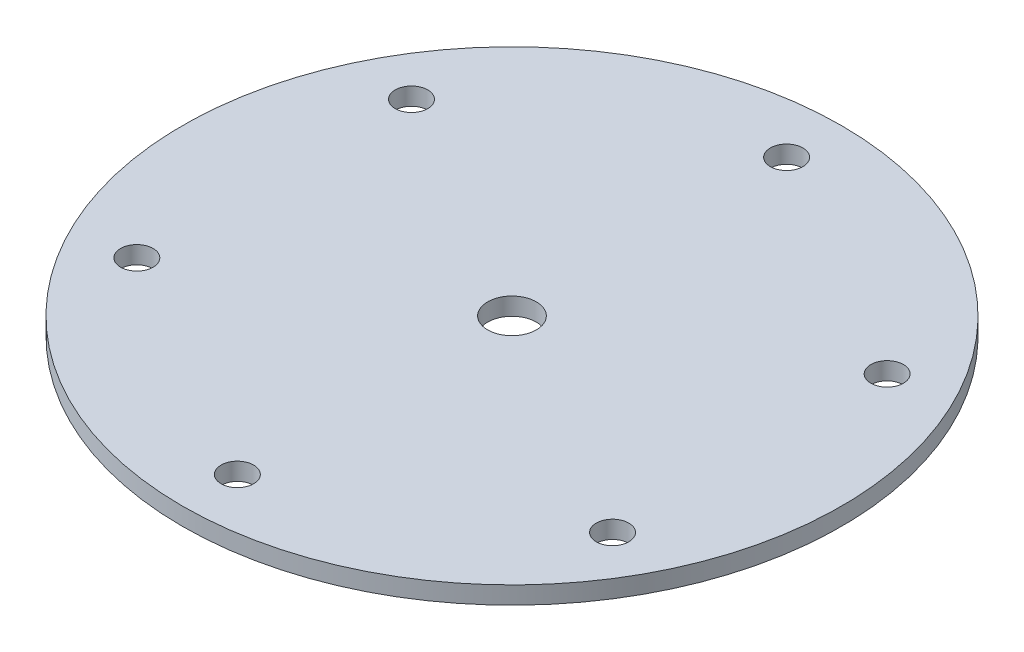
ISO-10303-21;
HEADER;
FILE_DESCRIPTION(('STEP AP214'),'2;1');
FILE_NAME('part.step','',(''),(''),'','','');
FILE_SCHEMA(('AUTOMOTIVE_DESIGN { 1 0 10303 214 1 1 1 1 }'));
ENDSEC;
DATA;
#1=APPLICATION_CONTEXT('core data for automotive mechanical design processes');
#2=APPLICATION_PROTOCOL_DEFINITION('international standard','automotive_design',2000,#1);
#3=PRODUCT_CONTEXT('',#1,'mechanical');
#4=PRODUCT('Part','Part','',(#3));
#5=PRODUCT_RELATED_PRODUCT_CATEGORY('part','',(#4));
#6=PRODUCT_DEFINITION_FORMATION('','',#4);
#7=PRODUCT_DEFINITION_CONTEXT('part definition',#1,'design');
#8=PRODUCT_DEFINITION('design','',#6,#7);
#9=PRODUCT_DEFINITION_SHAPE('','',#8);
#10=(LENGTH_UNIT() NAMED_UNIT(*) SI_UNIT(.MILLI.,.METRE.));
#11=(NAMED_UNIT(*) PLANE_ANGLE_UNIT() SI_UNIT($,.RADIAN.));
#12=(NAMED_UNIT(*) SI_UNIT($,.STERADIAN.) SOLID_ANGLE_UNIT());
#13=UNCERTAINTY_MEASURE_WITH_UNIT(LENGTH_MEASURE(1.E-05),#10,'distance_accuracy_value','');
#14=(GEOMETRIC_REPRESENTATION_CONTEXT(3) GLOBAL_UNCERTAINTY_ASSIGNED_CONTEXT((#13)) GLOBAL_UNIT_ASSIGNED_CONTEXT((#10,
#11,#12)) REPRESENTATION_CONTEXT('',''));
#15=CARTESIAN_POINT('',(0.,0.,0.));
#16=DIRECTION('',(0.,0.,1.));
#17=DIRECTION('',(1.,0.,0.));
#18=AXIS2_PLACEMENT_3D('',#15,#16,#17);
#19=CARTESIAN_POINT('',(-41.2444598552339,3.048,23.8124999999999));
#20=DIRECTION('',(0.,1.,0.));
#21=DIRECTION('',(0.,0.,1.));
#22=AXIS2_PLACEMENT_3D('',#19,#20,#21);
#23=CYLINDRICAL_SURFACE('',#22,2.8194);
#24=CARTESIAN_POINT('',(-41.2444598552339,3.048,23.8124999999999));
#25=DIRECTION('',(0.,1.,0.));
#26=DIRECTION('',(0.,0.,1.));
#27=AXIS2_PLACEMENT_3D('',#24,#25,#26);
#28=CIRCLE('',#27,2.8194);
#29=CARTESIAN_POINT('',(-41.2444598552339,3.048,26.6318999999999));
#30=VERTEX_POINT('',#29);
#31=EDGE_CURVE('E72',#30,#30,#28,.T.);
#32=ORIENTED_EDGE('',*,*,#31,.T.);
#33=EDGE_LOOP('',(#32));
#34=FACE_BOUND('',#33,.T.);
#35=CARTESIAN_POINT('',(-41.2444598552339,0.,23.8124999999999));
#36=DIRECTION('',(0.,1.,0.));
#37=DIRECTION('',(0.,0.,1.));
#38=AXIS2_PLACEMENT_3D('',#35,#36,#37);
#39=CIRCLE('',#38,2.8194);
#40=CARTESIAN_POINT('',(-41.2444598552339,0.,26.6318999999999));
#41=VERTEX_POINT('',#40);
#42=EDGE_CURVE('E52',#41,#41,#39,.T.);
#43=ORIENTED_EDGE('',*,*,#42,.F.);
#44=EDGE_LOOP('',(#43));
#45=FACE_BOUND('',#44,.T.);
#46=ADVANCED_FACE('F35',(#34,#45),#23,.F.);
#47=CARTESIAN_POINT('',(41.2444598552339,3.048,23.8124999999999));
#48=DIRECTION('',(0.,1.,0.));
#49=DIRECTION('',(0.,0.,1.));
#50=AXIS2_PLACEMENT_3D('',#47,#48,#49);
#51=CYLINDRICAL_SURFACE('',#50,2.8194);
#52=CARTESIAN_POINT('',(41.2444598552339,3.048,23.8124999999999));
#53=DIRECTION('',(0.,1.,0.));
#54=DIRECTION('',(0.,0.,1.));
#55=AXIS2_PLACEMENT_3D('',#52,#53,#54);
#56=CIRCLE('',#55,2.8194);
#57=CARTESIAN_POINT('',(41.2444598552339,3.048,26.6318999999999));
#58=VERTEX_POINT('',#57);
#59=EDGE_CURVE('E76',#58,#58,#56,.T.);
#60=ORIENTED_EDGE('',*,*,#59,.T.);
#61=EDGE_LOOP('',(#60));
#62=FACE_BOUND('',#61,.T.);
#63=CARTESIAN_POINT('',(41.2444598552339,0.,23.8124999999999));
#64=DIRECTION('',(0.,1.,0.));
#65=DIRECTION('',(0.,0.,1.));
#66=AXIS2_PLACEMENT_3D('',#63,#64,#65);
#67=CIRCLE('',#66,2.8194);
#68=CARTESIAN_POINT('',(41.2444598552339,0.,26.6318999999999));
#69=VERTEX_POINT('',#68);
#70=EDGE_CURVE('E55',#69,#69,#67,.T.);
#71=ORIENTED_EDGE('',*,*,#70,.F.);
#72=EDGE_LOOP('',(#71));
#73=FACE_BOUND('',#72,.T.);
#74=ADVANCED_FACE('F115',(#62,#73),#51,.F.);
#75=CARTESIAN_POINT('',(0.,3.048,-47.625));
#76=DIRECTION('',(0.,1.,0.));
#77=DIRECTION('',(0.,0.,1.));
#78=AXIS2_PLACEMENT_3D('',#75,#76,#77);
#79=CYLINDRICAL_SURFACE('',#78,2.8194);
#80=CARTESIAN_POINT('',(0.,3.048,-47.625));
#81=DIRECTION('',(0.,1.,0.));
#82=DIRECTION('',(0.,0.,1.));
#83=AXIS2_PLACEMENT_3D('',#80,#81,#82);
#84=CIRCLE('',#83,2.8194);
#85=CARTESIAN_POINT('',(0.,3.048,-44.8056));
#86=VERTEX_POINT('',#85);
#87=EDGE_CURVE('E81',#86,#86,#84,.T.);
#88=ORIENTED_EDGE('',*,*,#87,.T.);
#89=EDGE_LOOP('',(#88));
#90=FACE_BOUND('',#89,.T.);
#91=CARTESIAN_POINT('',(0.,0.,-47.625));
#92=DIRECTION('',(0.,1.,0.));
#93=DIRECTION('',(0.,0.,1.));
#94=AXIS2_PLACEMENT_3D('',#91,#92,#93);
#95=CIRCLE('',#94,2.8194);
#96=CARTESIAN_POINT('',(0.,0.,-44.8056));
#97=VERTEX_POINT('',#96);
#98=EDGE_CURVE('E59',#97,#97,#95,.T.);
#99=ORIENTED_EDGE('',*,*,#98,.F.);
#100=EDGE_LOOP('',(#99));
#101=FACE_BOUND('',#100,.T.);
#102=ADVANCED_FACE('F121',(#90,#101),#79,.F.);
#103=CARTESIAN_POINT('',(0.,3.048,0.));
#104=DIRECTION('',(0.,1.,0.));
#105=DIRECTION('',(0.,0.,1.));
#106=AXIS2_PLACEMENT_3D('',#103,#104,#105);
#107=CYLINDRICAL_SURFACE('',#106,57.15);
#108=CARTESIAN_POINT('',(0.,3.048,0.));
#109=DIRECTION('',(0.,1.,0.));
#110=DIRECTION('',(0.,0.,1.));
#111=AXIS2_PLACEMENT_3D('',#108,#109,#110);
#112=CIRCLE('',#111,57.15);
#113=CARTESIAN_POINT('',(0.,3.048,57.15));
#114=VERTEX_POINT('',#113);
#115=EDGE_CURVE('E88',#114,#114,#112,.T.);
#116=ORIENTED_EDGE('',*,*,#115,.F.);
#117=EDGE_LOOP('',(#116));
#118=FACE_BOUND('',#117,.T.);
#119=CARTESIAN_POINT('',(0.,0.,0.));
#120=DIRECTION('',(0.,1.,0.));
#121=DIRECTION('',(0.,0.,1.));
#122=AXIS2_PLACEMENT_3D('',#119,#120,#121);
#123=CIRCLE('',#122,57.15);
#124=CARTESIAN_POINT('',(0.,0.,57.15));
#125=VERTEX_POINT('',#124);
#126=EDGE_CURVE('E62',#125,#125,#123,.T.);
#127=ORIENTED_EDGE('',*,*,#126,.T.);
#128=EDGE_LOOP('',(#127));
#129=FACE_BOUND('',#128,.T.);
#130=ADVANCED_FACE('F112',(#118,#129),#107,.T.);
#131=CARTESIAN_POINT('',(41.2444598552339,3.048,-23.8124999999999));
#132=DIRECTION('',(0.,1.,0.));
#133=DIRECTION('',(0.,0.,1.));
#134=AXIS2_PLACEMENT_3D('',#131,#132,#133);
#135=CYLINDRICAL_SURFACE('',#134,2.8194);
#136=CARTESIAN_POINT('',(41.2444598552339,3.048,-23.8124999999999));
#137=DIRECTION('',(0.,1.,0.));
#138=DIRECTION('',(0.,0.,1.));
#139=AXIS2_PLACEMENT_3D('',#136,#137,#138);
#140=CIRCLE('',#139,2.8194);
#141=CARTESIAN_POINT('',(41.2444598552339,3.048,-20.9930999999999));
#142=VERTEX_POINT('',#141);
#143=EDGE_CURVE('E48',#142,#142,#140,.T.);
#144=ORIENTED_EDGE('',*,*,#143,.T.);
#145=EDGE_LOOP('',(#144));
#146=FACE_BOUND('',#145,.T.);
#147=CARTESIAN_POINT('',(41.2444598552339,0.,-23.8124999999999));
#148=DIRECTION('',(0.,1.,0.));
#149=DIRECTION('',(0.,0.,1.));
#150=AXIS2_PLACEMENT_3D('',#147,#148,#149);
#151=CIRCLE('',#150,2.8194);
#152=CARTESIAN_POINT('',(41.2444598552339,0.,-20.9930999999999));
#153=VERTEX_POINT('',#152);
#154=EDGE_CURVE('E65',#153,#153,#151,.T.);
#155=ORIENTED_EDGE('',*,*,#154,.F.);
#156=EDGE_LOOP('',(#155));
#157=FACE_BOUND('',#156,.T.);
#158=ADVANCED_FACE('F93',(#146,#157),#135,.F.);
#159=CARTESIAN_POINT('',(0.,3.048,47.625));
#160=DIRECTION('',(0.,1.,0.));
#161=DIRECTION('',(0.,0.,1.));
#162=AXIS2_PLACEMENT_3D('',#159,#160,#161);
#163=CYLINDRICAL_SURFACE('',#162,2.8194);
#164=CARTESIAN_POINT('',(0.,3.048,47.625));
#165=DIRECTION('',(0.,1.,0.));
#166=DIRECTION('',(0.,0.,1.));
#167=AXIS2_PLACEMENT_3D('',#164,#165,#166);
#168=CIRCLE('',#167,2.8194);
#169=CARTESIAN_POINT('',(0.,3.048,50.4444));
#170=VERTEX_POINT('',#169);
#171=EDGE_CURVE('E43',#170,#170,#168,.T.);
#172=ORIENTED_EDGE('',*,*,#171,.T.);
#173=EDGE_LOOP('',(#172));
#174=FACE_BOUND('',#173,.T.);
#175=CARTESIAN_POINT('',(0.,0.,47.625));
#176=DIRECTION('',(0.,1.,0.));
#177=DIRECTION('',(0.,0.,1.));
#178=AXIS2_PLACEMENT_3D('',#175,#176,#177);
#179=CIRCLE('',#178,2.8194);
#180=CARTESIAN_POINT('',(0.,0.,50.4444));
#181=VERTEX_POINT('',#180);
#182=EDGE_CURVE('E67',#181,#181,#179,.T.);
#183=ORIENTED_EDGE('',*,*,#182,.F.);
#184=EDGE_LOOP('',(#183));
#185=FACE_BOUND('',#184,.T.);
#186=ADVANCED_FACE('F105',(#174,#185),#163,.F.);
#187=CARTESIAN_POINT('',(-41.244459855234,3.048,-23.8124999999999));
#188=DIRECTION('',(0.,1.,0.));
#189=DIRECTION('',(0.,0.,1.));
#190=AXIS2_PLACEMENT_3D('',#187,#188,#189);
#191=CYLINDRICAL_SURFACE('',#190,2.8194);
#192=CARTESIAN_POINT('',(-41.244459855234,3.048,-23.8124999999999));
#193=DIRECTION('',(0.,1.,0.));
#194=DIRECTION('',(0.,0.,1.));
#195=AXIS2_PLACEMENT_3D('',#192,#193,#194);
#196=CIRCLE('',#195,2.8194);
#197=CARTESIAN_POINT('',(-41.244459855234,3.048,-20.9930999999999));
#198=VERTEX_POINT('',#197);
#199=EDGE_CURVE('E10',#198,#198,#196,.T.);
#200=ORIENTED_EDGE('',*,*,#199,.T.);
#201=EDGE_LOOP('',(#200));
#202=FACE_BOUND('',#201,.T.);
#203=CARTESIAN_POINT('',(-41.244459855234,0.,-23.8124999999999));
#204=DIRECTION('',(0.,1.,0.));
#205=DIRECTION('',(0.,0.,1.));
#206=AXIS2_PLACEMENT_3D('',#203,#204,#205);
#207=CIRCLE('',#206,2.8194);
#208=CARTESIAN_POINT('',(-41.244459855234,0.,-20.9930999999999));
#209=VERTEX_POINT('',#208);
#210=EDGE_CURVE('E39',#209,#209,#207,.T.);
#211=ORIENTED_EDGE('',*,*,#210,.F.);
#212=EDGE_LOOP('',(#211));
#213=FACE_BOUND('',#212,.T.);
#214=ADVANCED_FACE('F37',(#202,#213),#191,.F.);
#215=CARTESIAN_POINT('',(0.,3.048,0.));
#216=DIRECTION('',(0.,1.,0.));
#217=DIRECTION('',(0.,0.,1.));
#218=AXIS2_PLACEMENT_3D('',#215,#216,#217);
#219=PLANE('',#218);
#220=CARTESIAN_POINT('',(0.,3.048,0.));
#221=DIRECTION('',(0.,1.,0.));
#222=DIRECTION('',(0.,0.,1.));
#223=AXIS2_PLACEMENT_3D('',#220,#221,#222);
#224=CIRCLE('',#223,4.2164);
#225=CARTESIAN_POINT('',(0.,3.048,4.2164));
#226=VERTEX_POINT('',#225);
#227=EDGE_CURVE('E56',#226,#226,#224,.T.);
#228=ORIENTED_EDGE('',*,*,#227,.F.);
#229=EDGE_LOOP('',(#228));
#230=FACE_BOUND('',#229,.T.);
#231=ORIENTED_EDGE('',*,*,#31,.F.);
#232=EDGE_LOOP('',(#231));
#233=FACE_BOUND('',#232,.T.);
#234=ORIENTED_EDGE('',*,*,#59,.F.);
#235=EDGE_LOOP('',(#234));
#236=FACE_BOUND('',#235,.T.);
#237=ORIENTED_EDGE('',*,*,#87,.F.);
#238=EDGE_LOOP('',(#237));
#239=FACE_BOUND('',#238,.T.);
#240=ORIENTED_EDGE('',*,*,#115,.T.);
#241=EDGE_LOOP('',(#240));
#242=FACE_BOUND('',#241,.T.);
#243=ORIENTED_EDGE('',*,*,#143,.F.);
#244=EDGE_LOOP('',(#243));
#245=FACE_BOUND('',#244,.T.);
#246=ORIENTED_EDGE('',*,*,#171,.F.);
#247=EDGE_LOOP('',(#246));
#248=FACE_BOUND('',#247,.T.);
#249=ORIENTED_EDGE('',*,*,#199,.F.);
#250=EDGE_LOOP('',(#249));
#251=FACE_BOUND('',#250,.T.);
#252=ADVANCED_FACE('F96',(#230,#233,#236,#239,#242,#245,#248,#251),#219,.T.);
#253=CARTESIAN_POINT('',(0.,0.,0.));
#254=DIRECTION('',(0.,1.,0.));
#255=DIRECTION('',(0.,0.,1.));
#256=AXIS2_PLACEMENT_3D('',#253,#254,#255);
#257=PLANE('',#256);
#258=CARTESIAN_POINT('',(0.,0.,0.));
#259=DIRECTION('',(0.,1.,0.));
#260=DIRECTION('',(0.,0.,1.));
#261=AXIS2_PLACEMENT_3D('',#258,#259,#260);
#262=CIRCLE('',#261,4.2164);
#263=CARTESIAN_POINT('',(0.,0.,4.2164));
#264=VERTEX_POINT('',#263);
#265=EDGE_CURVE('E152',#264,#264,#262,.T.);
#266=ORIENTED_EDGE('',*,*,#265,.T.);
#267=EDGE_LOOP('',(#266));
#268=FACE_BOUND('',#267,.T.);
#269=ORIENTED_EDGE('',*,*,#42,.T.);
#270=EDGE_LOOP('',(#269));
#271=FACE_BOUND('',#270,.T.);
#272=ORIENTED_EDGE('',*,*,#70,.T.);
#273=EDGE_LOOP('',(#272));
#274=FACE_BOUND('',#273,.T.);
#275=ORIENTED_EDGE('',*,*,#98,.T.);
#276=EDGE_LOOP('',(#275));
#277=FACE_BOUND('',#276,.T.);
#278=ORIENTED_EDGE('',*,*,#126,.F.);
#279=EDGE_LOOP('',(#278));
#280=FACE_BOUND('',#279,.T.);
#281=ORIENTED_EDGE('',*,*,#154,.T.);
#282=EDGE_LOOP('',(#281));
#283=FACE_BOUND('',#282,.T.);
#284=ORIENTED_EDGE('',*,*,#182,.T.);
#285=EDGE_LOOP('',(#284));
#286=FACE_BOUND('',#285,.T.);
#287=ORIENTED_EDGE('',*,*,#210,.T.);
#288=EDGE_LOOP('',(#287));
#289=FACE_BOUND('',#288,.T.);
#290=ADVANCED_FACE('F99',(#268,#271,#274,#277,#280,#283,#286,#289),#257,.F.);
#291=CARTESIAN_POINT('',(0.,0.,0.));
#292=DIRECTION('',(0.,1.,0.));
#293=DIRECTION('',(0.,0.,1.));
#294=AXIS2_PLACEMENT_3D('',#291,#292,#293);
#295=CYLINDRICAL_SURFACE('',#294,4.2164);
#296=CARTESIAN_POINT('',(0.,3.048,4.2164));
#297=CARTESIAN_POINT('',(0.,3.01625,4.2164));
#298=CARTESIAN_POINT('',(0.,2.9845,4.2164));
#299=CARTESIAN_POINT('',(0.,2.921,4.2164));
#300=CARTESIAN_POINT('',(0.,2.88925,4.2164));
#301=CARTESIAN_POINT('',(0.,2.82575,4.2164));
#302=CARTESIAN_POINT('',(0.,2.794,4.2164));
#303=CARTESIAN_POINT('',(0.,2.7305,4.2164));
#304=CARTESIAN_POINT('',(0.,2.69875,4.2164));
#305=CARTESIAN_POINT('',(0.,2.63525,4.2164));
#306=CARTESIAN_POINT('',(0.,2.6035,4.2164));
#307=CARTESIAN_POINT('',(0.,2.54,4.2164));
#308=CARTESIAN_POINT('',(0.,2.50825,4.2164));
#309=CARTESIAN_POINT('',(0.,2.44475,4.2164));
#310=CARTESIAN_POINT('',(0.,2.413,4.2164));
#311=CARTESIAN_POINT('',(0.,2.3495,4.2164));
#312=CARTESIAN_POINT('',(0.,2.31775,4.2164));
#313=CARTESIAN_POINT('',(0.,2.25425,4.2164));
#314=CARTESIAN_POINT('',(0.,2.2225,4.2164));
#315=CARTESIAN_POINT('',(0.,2.159,4.2164));
#316=CARTESIAN_POINT('',(0.,2.12725,4.2164));
#317=CARTESIAN_POINT('',(0.,2.06375,4.2164));
#318=CARTESIAN_POINT('',(0.,2.032,4.2164));
#319=CARTESIAN_POINT('',(0.,1.9685,4.2164));
#320=CARTESIAN_POINT('',(0.,1.93675,4.2164));
#321=CARTESIAN_POINT('',(0.,1.87325,4.2164));
#322=CARTESIAN_POINT('',(0.,1.8415,4.2164));
#323=CARTESIAN_POINT('',(0.,1.778,4.2164));
#324=CARTESIAN_POINT('',(0.,1.74625,4.2164));
#325=CARTESIAN_POINT('',(0.,1.68275,4.2164));
#326=CARTESIAN_POINT('',(0.,1.651,4.2164));
#327=CARTESIAN_POINT('',(0.,1.5875,4.2164));
#328=CARTESIAN_POINT('',(0.,1.55575,4.2164));
#329=CARTESIAN_POINT('',(0.,1.49225,4.2164));
#330=CARTESIAN_POINT('',(0.,1.4605,4.2164));
#331=CARTESIAN_POINT('',(0.,1.397,4.2164));
#332=CARTESIAN_POINT('',(0.,1.36525,4.2164));
#333=CARTESIAN_POINT('',(0.,1.30175,4.2164));
#334=CARTESIAN_POINT('',(0.,1.27,4.2164));
#335=CARTESIAN_POINT('',(0.,1.2065,4.2164));
#336=CARTESIAN_POINT('',(0.,1.17475,4.2164));
#337=CARTESIAN_POINT('',(0.,1.11125,4.2164));
#338=CARTESIAN_POINT('',(0.,1.0795,4.2164));
#339=CARTESIAN_POINT('',(0.,1.016,4.2164));
#340=CARTESIAN_POINT('',(0.,0.98425,4.2164));
#341=CARTESIAN_POINT('',(0.,0.92075,4.2164));
#342=CARTESIAN_POINT('',(0.,0.889,4.2164));
#343=CARTESIAN_POINT('',(0.,0.8255,4.2164));
#344=CARTESIAN_POINT('',(0.,0.79375,4.2164));
#345=CARTESIAN_POINT('',(0.,0.73025,4.2164));
#346=CARTESIAN_POINT('',(0.,0.6985,4.2164));
#347=CARTESIAN_POINT('',(0.,0.635,4.2164));
#348=CARTESIAN_POINT('',(0.,0.60325,4.2164));
#349=CARTESIAN_POINT('',(0.,0.53975,4.2164));
#350=CARTESIAN_POINT('',(0.,0.508,4.2164));
#351=CARTESIAN_POINT('',(0.,0.4445,4.2164));
#352=CARTESIAN_POINT('',(0.,0.41275,4.2164));
#353=CARTESIAN_POINT('',(0.,0.34925,4.2164));
#354=CARTESIAN_POINT('',(0.,0.3175,4.2164));
#355=CARTESIAN_POINT('',(0.,0.254,4.2164));
#356=CARTESIAN_POINT('',(0.,0.22225,4.2164));
#357=CARTESIAN_POINT('',(0.,0.15875,4.2164));
#358=CARTESIAN_POINT('',(0.,0.127,4.2164));
#359=CARTESIAN_POINT('',(0.,0.0634999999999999,4.2164));
#360=CARTESIAN_POINT('',(0.,0.03175,4.2164));
#361=CARTESIAN_POINT('',(0.,0.,4.2164));
#362=B_SPLINE_CURVE_WITH_KNOTS('',3,(#296,#297,#298,#299,#300,#301,#302,#303,#304,#305,#306,
#307,#308,#309,#310,#311,#312,#313,#314,#315,#316,#317,#318,#319,#320,#321,#322,#323,#324,#325,
#326,#327,#328,#329,#330,#331,#332,#333,#334,#335,#336,#337,#338,#339,#340,#341,#342,#343,#344,
#345,#346,#347,#348,#349,#350,#351,#352,#353,#354,#355,#356,#357,#358,#359,#360,#361),
.UNSPECIFIED.,.F.,.F.,(4,2,2,2,2,2,2,2,2,2,2,2,2,2,2,2,2,2,2,2,2,2,2,2,2,2,2,2,2,2,2,2,4),(0.,
0.0952499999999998,0.1905,0.28575,0.381,0.47625,0.5715,0.66675,0.762,0.85725,0.9525,1.04775,
1.143,1.23825,1.3335,1.42875,1.524,1.61925,1.7145,1.80975,1.905,2.00025,2.0955,2.19075,2.286,
2.38125,2.4765,2.57175,2.667,2.76225,2.8575,2.95275,3.048),.UNSPECIFIED.);
#363=EDGE_CURVE('BSEAM140',#226,#264,#362,.T.);
#364=ORIENTED_EDGE('',*,*,#227,.T.);
#365=ORIENTED_EDGE('',*,*,#265,.F.);
#366=ORIENTED_EDGE('',*,*,#363,.T.);
#367=ORIENTED_EDGE('',*,*,#363,.F.);
#368=EDGE_LOOP('',(#364,#366,#365,#367));
#369=FACE_BOUND('',#368,.T.);
#370=ADVANCED_FACE('F140',(#369),#295,.F.);
#371=CLOSED_SHELL('',(#46,#74,#102,#130,#158,#186,#214,#252,#290,#370));
#372=MANIFOLD_SOLID_BREP('B2',#371);
#373=ADVANCED_BREP_SHAPE_REPRESENTATION('',(#18,#372),#14);
#374=SHAPE_DEFINITION_REPRESENTATION(#9,#373);
ENDSEC;
END-ISO-10303-21;
